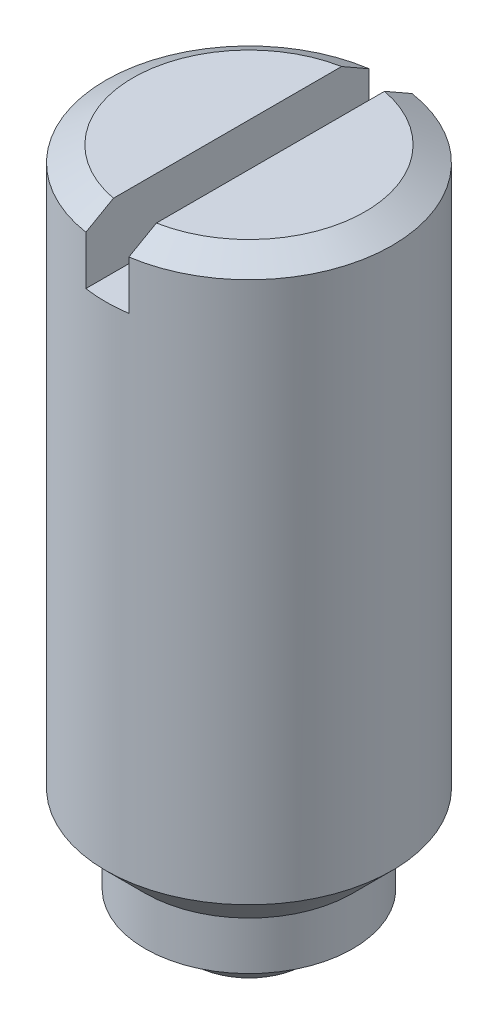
ISO-10303-21;
HEADER;
FILE_DESCRIPTION(('STEP AP214'),'2;1');
FILE_NAME('part.step','',(''),(''),'','','');
FILE_SCHEMA(('AUTOMOTIVE_DESIGN { 1 0 10303 214 1 1 1 1 }'));
ENDSEC;
DATA;
#1=APPLICATION_CONTEXT('core data for automotive mechanical design processes');
#2=APPLICATION_PROTOCOL_DEFINITION('international standard','automotive_design',2000,#1);
#3=PRODUCT_CONTEXT('',#1,'mechanical');
#4=PRODUCT('Part','Part','',(#3));
#5=PRODUCT_RELATED_PRODUCT_CATEGORY('part','',(#4));
#6=PRODUCT_DEFINITION_FORMATION('','',#4);
#7=PRODUCT_DEFINITION_CONTEXT('part definition',#1,'design');
#8=PRODUCT_DEFINITION('design','',#6,#7);
#9=PRODUCT_DEFINITION_SHAPE('','',#8);
#10=(LENGTH_UNIT() NAMED_UNIT(*) SI_UNIT(.MILLI.,.METRE.));
#11=(NAMED_UNIT(*) PLANE_ANGLE_UNIT() SI_UNIT($,.RADIAN.));
#12=(NAMED_UNIT(*) SI_UNIT($,.STERADIAN.) SOLID_ANGLE_UNIT());
#13=UNCERTAINTY_MEASURE_WITH_UNIT(LENGTH_MEASURE(1.E-05),#10,'distance_accuracy_value','');
#14=(GEOMETRIC_REPRESENTATION_CONTEXT(3) GLOBAL_UNCERTAINTY_ASSIGNED_CONTEXT((#13)) GLOBAL_UNIT_ASSIGNED_CONTEXT((#10,
#11,#12)) REPRESENTATION_CONTEXT('',''));
#15=CARTESIAN_POINT('',(0.,0.,0.));
#16=DIRECTION('',(0.,0.,1.));
#17=DIRECTION('',(1.,0.,0.));
#18=AXIS2_PLACEMENT_3D('',#15,#16,#17);
#19=CARTESIAN_POINT('',(0.,9.,0.));
#20=DIRECTION('',(0.,-1.,0.));
#21=DIRECTION('',(0.,0.,-1.));
#22=AXIS2_PLACEMENT_3D('',#19,#20,#21);
#23=CONICAL_SURFACE('',#22,1.621125,1.0471975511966);
#24=CARTESIAN_POINT('',(-0.3,7.95512242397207,-3.41776481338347));
#25=CARTESIAN_POINT('',(-0.3,8.03456601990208,-3.27962757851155));
#26=CARTESIAN_POINT('',(-0.3,8.11398823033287,-3.14147800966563));
#27=CARTESIAN_POINT('',(-0.3,8.27274965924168,-2.86513132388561));
#28=CARTESIAN_POINT('',(-0.3,8.35208887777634,-2.72693420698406));
#29=CARTESIAN_POINT('',(-0.3,8.51064198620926,-2.45047323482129));
#30=CARTESIAN_POINT('',(-0.3,8.58985587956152,-2.3122093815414));
#31=CARTESIAN_POINT('',(-0.3,8.74807950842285,-2.03556492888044));
#32=CARTESIAN_POINT('',(-0.3,8.8270892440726,-1.8971843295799));
#33=CARTESIAN_POINT('',(-0.3,8.94882147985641,-1.68329097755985));
#34=CARTESIAN_POINT('',(-0.3,8.99167880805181,-1.60785501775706));
#35=CARTESIAN_POINT('',(-0.3,9.07721695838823,-1.45688367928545));
#36=CARTESIAN_POINT('',(-0.3,9.11989778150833,-1.38134830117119));
#37=CARTESIAN_POINT('',(-0.3,9.20499700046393,-1.23012724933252));
#38=CARTESIAN_POINT('',(-0.3,9.24741539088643,-1.15444157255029));
#39=CARTESIAN_POINT('',(-0.3,9.33174511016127,-1.00278677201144));
#40=CARTESIAN_POINT('',(-0.3,9.37365642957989,-0.926817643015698));
#41=CARTESIAN_POINT('',(-0.3,9.41519154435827,-0.850640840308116));
#42=B_SPLINE_CURVE_WITH_KNOTS('',3,(#24,#25,#26,#27,#28,#29,#30,#31,#32,#33,#34,#35,#36,#37,#38,
#39,#40,#41),.UNSPECIFIED.,.F.,.F.,(4,2,2,2,2,2,2,2,4),(0.,0.478057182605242,0.956114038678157,
1.43415748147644,1.91220059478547,2.17248103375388,2.43276002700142,2.69304437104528,
2.9533335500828),.UNSPECIFIED.);
#43=CARTESIAN_POINT('',(-0.3,8.78125641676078,-1.97737199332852));
#44=VERTEX_POINT('',#43);
#45=CARTESIAN_POINT('',(-0.3,9.,-1.5931246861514));
#46=VERTEX_POINT('',#45);
#47=EDGE_CURVE('E160',#44,#46,#42,.T.);
#48=ORIENTED_EDGE('',*,*,#47,.F.);
#49=CARTESIAN_POINT('',(0.,8.78125641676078,0.));
#50=DIRECTION('',(0.,1.,0.));
#51=DIRECTION('',(0.,0.,1.));
#52=AXIS2_PLACEMENT_3D('',#49,#50,#51);
#53=CIRCLE('',#52,2.);
#54=CARTESIAN_POINT('',(-0.3,8.78125641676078,1.97737199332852));
#55=VERTEX_POINT('',#54);
#56=EDGE_CURVE('E92',#44,#55,#53,.T.);
#57=ORIENTED_EDGE('',*,*,#56,.T.);
#58=CARTESIAN_POINT('',(-0.3,9.41519154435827,0.850640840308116));
#59=CARTESIAN_POINT('',(-0.3,9.37365642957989,0.926817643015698));
#60=CARTESIAN_POINT('',(-0.3,9.33174511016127,1.00278677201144));
#61=CARTESIAN_POINT('',(-0.3,9.24741539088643,1.15444157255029));
#62=CARTESIAN_POINT('',(-0.3,9.20499700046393,1.23012724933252));
#63=CARTESIAN_POINT('',(-0.3,9.11989778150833,1.38134830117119));
#64=CARTESIAN_POINT('',(-0.3,9.07721695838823,1.45688367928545));
#65=CARTESIAN_POINT('',(-0.3,8.99167880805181,1.60785501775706));
#66=CARTESIAN_POINT('',(-0.3,8.94882147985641,1.68329097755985));
#67=CARTESIAN_POINT('',(-0.3,8.8270892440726,1.8971843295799));
#68=CARTESIAN_POINT('',(-0.3,8.74807950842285,2.03556492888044));
#69=CARTESIAN_POINT('',(-0.3,8.58985587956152,2.3122093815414));
#70=CARTESIAN_POINT('',(-0.3,8.51064198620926,2.45047323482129));
#71=CARTESIAN_POINT('',(-0.3,8.35208887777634,2.72693420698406));
#72=CARTESIAN_POINT('',(-0.3,8.27274965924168,2.86513132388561));
#73=CARTESIAN_POINT('',(-0.3,8.11398823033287,3.14147800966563));
#74=CARTESIAN_POINT('',(-0.3,8.03456601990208,3.27962757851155));
#75=CARTESIAN_POINT('',(-0.3,7.95512242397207,3.41776481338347));
#76=B_SPLINE_CURVE_WITH_KNOTS('',3,(#58,#59,#60,#61,#62,#63,#64,#65,#66,#67,#68,#69,#70,#71,#72,
#73,#74,#75),.UNSPECIFIED.,.F.,.F.,(4,2,2,2,2,2,2,2,4),(0.,0.260289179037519,0.520573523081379,
0.780852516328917,1.04113295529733,1.51917606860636,1.99721951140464,2.47527636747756,
2.9533335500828),.UNSPECIFIED.);
#77=CARTESIAN_POINT('',(-0.3,9.,1.5931246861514));
#78=VERTEX_POINT('',#77);
#79=EDGE_CURVE('E155',#78,#55,#76,.T.);
#80=ORIENTED_EDGE('',*,*,#79,.F.);
#81=CARTESIAN_POINT('',(0.,9.,0.));
#82=DIRECTION('',(0.,1.,0.));
#83=DIRECTION('',(0.,0.,1.));
#84=AXIS2_PLACEMENT_3D('',#81,#82,#83);
#85=CIRCLE('',#84,1.621125);
#86=EDGE_CURVE('E93',#46,#78,#85,.T.);
#87=ORIENTED_EDGE('',*,*,#86,.F.);
#88=EDGE_LOOP('',(#48,#57,#80,#87));
#89=FACE_BOUND('',#88,.T.);
#90=ADVANCED_FACE('F15',(#89),#23,.T.);
#91=CARTESIAN_POINT('',(0.,9.,0.));
#92=DIRECTION('',(0.,1.,0.));
#93=DIRECTION('',(0.,0.,1.));
#94=AXIS2_PLACEMENT_3D('',#91,#92,#93);
#95=PLANE('',#94);
#96=DIRECTION('',(0.,0.,1.));
#97=VECTOR('',#96,1.);
#98=CARTESIAN_POINT('',(-0.3,9.,-2.));
#99=LINE('',#98,#97);
#100=EDGE_CURVE('E79',#46,#78,#99,.T.);
#101=ORIENTED_EDGE('',*,*,#100,.F.);
#102=ORIENTED_EDGE('',*,*,#86,.T.);
#103=EDGE_LOOP('',(#101,#102));
#104=FACE_BOUND('',#103,.T.);
#105=ADVANCED_FACE('F173',(#104),#95,.T.);
#106=CARTESIAN_POINT('',(0.,9.,0.));
#107=DIRECTION('',(0.,1.,0.));
#108=DIRECTION('',(0.,0.,1.));
#109=AXIS2_PLACEMENT_3D('',#106,#107,#108);
#110=CYLINDRICAL_SURFACE('',#109,1.25);
#111=CARTESIAN_POINT('',(0.,0.45,0.));
#112=DIRECTION('',(0.,-1.,0.));
#113=DIRECTION('',(0.,0.,-1.));
#114=AXIS2_PLACEMENT_3D('',#111,#112,#113);
#115=CIRCLE('',#114,1.25);
#116=CARTESIAN_POINT('',(0.,0.45,-1.25));
#117=VERTEX_POINT('',#116);
#118=EDGE_CURVE('E176',#117,#117,#115,.T.);
#119=ORIENTED_EDGE('',*,*,#118,.F.);
#120=EDGE_LOOP('',(#119));
#121=FACE_BOUND('',#120,.T.);
#122=CARTESIAN_POINT('',(0.,0.,0.));
#123=DIRECTION('',(0.,1.,0.));
#124=DIRECTION('',(0.,0.,1.));
#125=AXIS2_PLACEMENT_3D('',#122,#123,#124);
#126=CIRCLE('',#125,1.25);
#127=CARTESIAN_POINT('',(0.,0.,1.25));
#128=VERTEX_POINT('',#127);
#129=EDGE_CURVE('E110',#128,#128,#126,.T.);
#130=ORIENTED_EDGE('',*,*,#129,.F.);
#131=EDGE_LOOP('',(#130));
#132=FACE_BOUND('',#131,.T.);
#133=ADVANCED_FACE('F17',(#121,#132),#110,.F.);
#134=CARTESIAN_POINT('',(1.25,0.,0.));
#135=DIRECTION('',(0.,1.,0.));
#136=DIRECTION('',(0.,0.,1.));
#137=AXIS2_PLACEMENT_3D('',#134,#135,#136);
#138=PLANE('',#137);
#139=CARTESIAN_POINT('',(0.,0.,0.));
#140=DIRECTION('',(0.,1.,0.));
#141=DIRECTION('',(0.,0.,1.));
#142=AXIS2_PLACEMENT_3D('',#139,#140,#141);
#143=CIRCLE('',#142,1.45);
#144=CARTESIAN_POINT('',(0.,0.,1.45));
#145=VERTEX_POINT('',#144);
#146=EDGE_CURVE('E108',#145,#145,#143,.T.);
#147=ORIENTED_EDGE('',*,*,#146,.F.);
#148=EDGE_LOOP('',(#147));
#149=FACE_BOUND('',#148,.T.);
#150=ORIENTED_EDGE('',*,*,#129,.T.);
#151=EDGE_LOOP('',(#150));
#152=FACE_BOUND('',#151,.T.);
#153=ADVANCED_FACE('F184',(#149,#152),#138,.F.);
#154=CARTESIAN_POINT('',(0.,9.,0.));
#155=DIRECTION('',(0.,1.,0.));
#156=DIRECTION('',(0.,0.,1.));
#157=AXIS2_PLACEMENT_3D('',#154,#155,#156);
#158=CYLINDRICAL_SURFACE('',#157,1.45);
#159=CARTESIAN_POINT('',(0.,0.67125641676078,0.));
#160=DIRECTION('',(0.,1.,0.));
#161=DIRECTION('',(0.,0.,1.));
#162=AXIS2_PLACEMENT_3D('',#159,#160,#161);
#163=CIRCLE('',#162,1.45);
#164=CARTESIAN_POINT('',(0.,0.67125641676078,1.45));
#165=VERTEX_POINT('',#164);
#166=EDGE_CURVE('E105',#165,#165,#163,.T.);
#167=ORIENTED_EDGE('',*,*,#166,.F.);
#168=EDGE_LOOP('',(#167));
#169=FACE_BOUND('',#168,.T.);
#170=ORIENTED_EDGE('',*,*,#146,.T.);
#171=EDGE_LOOP('',(#170));
#172=FACE_BOUND('',#171,.T.);
#173=ADVANCED_FACE('F188',(#169,#172),#158,.T.);
#174=CARTESIAN_POINT('',(0.,1.22125641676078,0.));
#175=DIRECTION('',(0.,1.,0.));
#176=DIRECTION('',(0.,0.,1.));
#177=AXIS2_PLACEMENT_3D('',#174,#175,#176);
#178=CONICAL_SURFACE('',#177,2.,0.785398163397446);
#179=ORIENTED_EDGE('',*,*,#166,.T.);
#180=EDGE_LOOP('',(#179));
#181=FACE_BOUND('',#180,.T.);
#182=CARTESIAN_POINT('',(0.,1.22125641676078,0.));
#183=DIRECTION('',(0.,1.,0.));
#184=DIRECTION('',(0.,0.,1.));
#185=AXIS2_PLACEMENT_3D('',#182,#183,#184);
#186=CIRCLE('',#185,2.);
#187=CARTESIAN_POINT('',(0.,1.22125641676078,2.));
#188=VERTEX_POINT('',#187);
#189=EDGE_CURVE('E102',#188,#188,#186,.T.);
#190=ORIENTED_EDGE('',*,*,#189,.F.);
#191=EDGE_LOOP('',(#190));
#192=FACE_BOUND('',#191,.T.);
#193=ADVANCED_FACE('F197',(#181,#192),#178,.T.);
#194=CARTESIAN_POINT('',(0.,9.,0.));
#195=DIRECTION('',(0.,1.,0.));
#196=DIRECTION('',(0.,0.,1.));
#197=AXIS2_PLACEMENT_3D('',#194,#195,#196);
#198=CYLINDRICAL_SURFACE('',#197,2.);
#199=DIRECTION('',(0.,1.,0.));
#200=VECTOR('',#199,1.);
#201=CARTESIAN_POINT('',(-0.3,9.,1.97737199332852));
#202=LINE('',#201,#200);
#203=CARTESIAN_POINT('',(-0.3,8.1,1.97737199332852));
#204=VERTEX_POINT('',#203);
#205=EDGE_CURVE('E164',#55,#204,#202,.F.);
#206=ORIENTED_EDGE('',*,*,#205,.F.);
#207=ORIENTED_EDGE('',*,*,#56,.F.);
#208=DIRECTION('',(0.,1.,0.));
#209=VECTOR('',#208,1.);
#210=CARTESIAN_POINT('',(-0.3,9.,-1.97737199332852));
#211=LINE('',#210,#209);
#212=CARTESIAN_POINT('',(-0.3,8.1,-1.97737199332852));
#213=VERTEX_POINT('',#212);
#214=EDGE_CURVE('E98',#213,#44,#211,.T.);
#215=ORIENTED_EDGE('',*,*,#214,.F.);
#216=CARTESIAN_POINT('',(0.,8.1,0.));
#217=DIRECTION('',(0.,-1.,0.));
#218=DIRECTION('',(0.,0.,-1.));
#219=AXIS2_PLACEMENT_3D('',#216,#217,#218);
#220=CIRCLE('',#219,2.);
#221=CARTESIAN_POINT('',(0.,8.1,-2.));
#222=VERTEX_POINT('',#221);
#223=EDGE_CURVE('E114',#222,#213,#220,.F.);
#224=ORIENTED_EDGE('',*,*,#223,.F.);
#225=CARTESIAN_POINT('',(0.3,8.1,-1.97737199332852));
#226=VERTEX_POINT('',#225);
#227=EDGE_CURVE('E19',#226,#222,#220,.F.);
#228=ORIENTED_EDGE('',*,*,#227,.F.);
#229=DIRECTION('',(0.,1.,0.));
#230=VECTOR('',#229,1.);
#231=CARTESIAN_POINT('',(0.3,9.,-1.97737199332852));
#232=LINE('',#231,#230);
#233=CARTESIAN_POINT('',(0.3,8.78125641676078,-1.97737199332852));
#234=VERTEX_POINT('',#233);
#235=EDGE_CURVE('E88',#234,#226,#232,.F.);
#236=ORIENTED_EDGE('',*,*,#235,.F.);
#237=CARTESIAN_POINT('',(0.3,8.78125641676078,1.97737199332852));
#238=VERTEX_POINT('',#237);
#239=EDGE_CURVE('E87',#238,#234,#53,.T.);
#240=ORIENTED_EDGE('',*,*,#239,.F.);
#241=DIRECTION('',(0.,1.,0.));
#242=VECTOR('',#241,1.);
#243=CARTESIAN_POINT('',(0.3,9.,1.97737199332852));
#244=LINE('',#243,#242);
#245=CARTESIAN_POINT('',(0.3,8.1,1.97737199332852));
#246=VERTEX_POINT('',#245);
#247=EDGE_CURVE('E89',#246,#238,#244,.T.);
#248=ORIENTED_EDGE('',*,*,#247,.F.);
#249=CARTESIAN_POINT('',(0.,8.1,2.));
#250=VERTEX_POINT('',#249);
#251=EDGE_CURVE('E24',#250,#246,#220,.F.);
#252=ORIENTED_EDGE('',*,*,#251,.F.);
#253=EDGE_CURVE('E10',#204,#250,#220,.F.);
#254=ORIENTED_EDGE('',*,*,#253,.F.);
#255=EDGE_LOOP('',(#206,#207,#215,#224,#228,#236,#240,#248,#252,#254));
#256=FACE_BOUND('',#255,.T.);
#257=ORIENTED_EDGE('',*,*,#189,.T.);
#258=EDGE_LOOP('',(#257));
#259=FACE_BOUND('',#258,.T.);
#260=ADVANCED_FACE('F126',(#256,#259),#198,.T.);
#261=CARTESIAN_POINT('',(0.3,9.41519154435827,-0.850640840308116));
#262=CARTESIAN_POINT('',(0.3,9.37365642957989,-0.926817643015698));
#263=CARTESIAN_POINT('',(0.3,9.33174511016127,-1.00278677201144));
#264=CARTESIAN_POINT('',(0.3,9.24741539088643,-1.15444157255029));
#265=CARTESIAN_POINT('',(0.3,9.20499700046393,-1.23012724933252));
#266=CARTESIAN_POINT('',(0.3,9.11989778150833,-1.38134830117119));
#267=CARTESIAN_POINT('',(0.3,9.07721695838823,-1.45688367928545));
#268=CARTESIAN_POINT('',(0.3,8.99167880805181,-1.60785501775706));
#269=CARTESIAN_POINT('',(0.3,8.94882147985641,-1.68329097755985));
#270=CARTESIAN_POINT('',(0.3,8.8270892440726,-1.8971843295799));
#271=CARTESIAN_POINT('',(0.3,8.74807950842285,-2.03556492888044));
#272=CARTESIAN_POINT('',(0.3,8.58985587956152,-2.3122093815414));
#273=CARTESIAN_POINT('',(0.3,8.51064198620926,-2.45047323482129));
#274=CARTESIAN_POINT('',(0.3,8.35208887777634,-2.72693420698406));
#275=CARTESIAN_POINT('',(0.3,8.27274965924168,-2.86513132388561));
#276=CARTESIAN_POINT('',(0.3,8.11398823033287,-3.14147800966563));
#277=CARTESIAN_POINT('',(0.3,8.03456601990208,-3.27962757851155));
#278=CARTESIAN_POINT('',(0.3,7.95512242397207,-3.41776481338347));
#279=B_SPLINE_CURVE_WITH_KNOTS('',3,(#261,#262,#263,#264,#265,#266,#267,#268,#269,#270,#271,
#272,#273,#274,#275,#276,#277,#278),.UNSPECIFIED.,.F.,.F.,(4,2,2,2,2,2,2,2,4),(0.,
0.260289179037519,0.520573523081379,0.780852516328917,1.04113295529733,1.51917606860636,
1.99721951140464,2.47527636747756,2.9533335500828),.UNSPECIFIED.);
#280=CARTESIAN_POINT('',(0.3,9.,-1.5931246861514));
#281=VERTEX_POINT('',#280);
#282=EDGE_CURVE('E74',#281,#234,#279,.T.);
#283=ORIENTED_EDGE('',*,*,#282,.F.);
#284=CARTESIAN_POINT('',(0.3,9.,1.5931246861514));
#285=VERTEX_POINT('',#284);
#286=EDGE_CURVE('E85',#285,#281,#85,.T.);
#287=ORIENTED_EDGE('',*,*,#286,.F.);
#288=CARTESIAN_POINT('',(0.3,7.95512242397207,3.41776481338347));
#289=CARTESIAN_POINT('',(0.3,8.03456601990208,3.27962757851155));
#290=CARTESIAN_POINT('',(0.3,8.11398823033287,3.14147800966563));
#291=CARTESIAN_POINT('',(0.3,8.27274965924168,2.86513132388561));
#292=CARTESIAN_POINT('',(0.3,8.35208887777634,2.72693420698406));
#293=CARTESIAN_POINT('',(0.3,8.51064198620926,2.45047323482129));
#294=CARTESIAN_POINT('',(0.3,8.58985587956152,2.3122093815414));
#295=CARTESIAN_POINT('',(0.3,8.74807950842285,2.03556492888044));
#296=CARTESIAN_POINT('',(0.3,8.8270892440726,1.8971843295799));
#297=CARTESIAN_POINT('',(0.3,8.94882147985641,1.68329097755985));
#298=CARTESIAN_POINT('',(0.3,8.99167880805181,1.60785501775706));
#299=CARTESIAN_POINT('',(0.3,9.07721695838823,1.45688367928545));
#300=CARTESIAN_POINT('',(0.3,9.11989778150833,1.38134830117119));
#301=CARTESIAN_POINT('',(0.3,9.20499700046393,1.23012724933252));
#302=CARTESIAN_POINT('',(0.3,9.24741539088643,1.15444157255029));
#303=CARTESIAN_POINT('',(0.3,9.33174511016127,1.00278677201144));
#304=CARTESIAN_POINT('',(0.3,9.37365642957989,0.926817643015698));
#305=CARTESIAN_POINT('',(0.3,9.41519154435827,0.850640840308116));
#306=B_SPLINE_CURVE_WITH_KNOTS('',3,(#288,#289,#290,#291,#292,#293,#294,#295,#296,#297,#298,
#299,#300,#301,#302,#303,#304,#305),.UNSPECIFIED.,.F.,.F.,(4,2,2,2,2,2,2,2,4),(0.,
0.478057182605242,0.956114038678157,1.43415748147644,1.91220059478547,2.17248103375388,
2.43276002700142,2.69304437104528,2.9533335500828),.UNSPECIFIED.);
#307=EDGE_CURVE('E31',#238,#285,#306,.T.);
#308=ORIENTED_EDGE('',*,*,#307,.F.);
#309=ORIENTED_EDGE('',*,*,#239,.T.);
#310=EDGE_LOOP('',(#283,#287,#308,#309));
#311=FACE_BOUND('',#310,.T.);
#312=ADVANCED_FACE('F84',(#311),#23,.T.);
#313=DIRECTION('',(0.,0.,1.));
#314=VECTOR('',#313,1.);
#315=CARTESIAN_POINT('',(0.3,9.,-2.));
#316=LINE('',#315,#314);
#317=EDGE_CURVE('E71',#281,#285,#316,.T.);
#318=ORIENTED_EDGE('',*,*,#317,.T.);
#319=ORIENTED_EDGE('',*,*,#286,.T.);
#320=EDGE_LOOP('',(#318,#319));
#321=FACE_BOUND('',#320,.T.);
#322=ADVANCED_FACE('F91',(#321),#95,.T.);
#323=CARTESIAN_POINT('',(-0.3,8.55,-2.));
#324=DIRECTION('',(-1.,0.,0.));
#325=DIRECTION('',(0.,0.,-1.));
#326=AXIS2_PLACEMENT_3D('',#323,#324,#325);
#327=PLANE('',#326);
#328=ORIENTED_EDGE('',*,*,#214,.T.);
#329=ORIENTED_EDGE('',*,*,#47,.T.);
#330=ORIENTED_EDGE('',*,*,#100,.T.);
#331=ORIENTED_EDGE('',*,*,#79,.T.);
#332=ORIENTED_EDGE('',*,*,#205,.T.);
#333=DIRECTION('',(0.,0.,1.));
#334=VECTOR('',#333,1.);
#335=CARTESIAN_POINT('',(-0.3,8.1,-2.));
#336=LINE('',#335,#334);
#337=EDGE_CURVE('E123',#213,#204,#336,.T.);
#338=ORIENTED_EDGE('',*,*,#337,.F.);
#339=EDGE_LOOP('',(#328,#329,#330,#331,#332,#338));
#340=FACE_BOUND('',#339,.T.);
#341=ADVANCED_FACE('F148',(#340),#327,.F.);
#342=CARTESIAN_POINT('',(0.3,8.55,-2.));
#343=DIRECTION('',(1.,0.,0.));
#344=DIRECTION('',(0.,0.,1.));
#345=AXIS2_PLACEMENT_3D('',#342,#343,#344);
#346=PLANE('',#345);
#347=ORIENTED_EDGE('',*,*,#235,.T.);
#348=DIRECTION('',(0.,0.,1.));
#349=VECTOR('',#348,1.);
#350=CARTESIAN_POINT('',(0.3,8.1,-2.));
#351=LINE('',#350,#349);
#352=EDGE_CURVE('E80',#226,#246,#351,.T.);
#353=ORIENTED_EDGE('',*,*,#352,.T.);
#354=ORIENTED_EDGE('',*,*,#247,.T.);
#355=ORIENTED_EDGE('',*,*,#307,.T.);
#356=ORIENTED_EDGE('',*,*,#317,.F.);
#357=ORIENTED_EDGE('',*,*,#282,.T.);
#358=EDGE_LOOP('',(#347,#353,#354,#355,#356,#357));
#359=FACE_BOUND('',#358,.T.);
#360=ADVANCED_FACE('F73',(#359),#346,.F.);
#361=CARTESIAN_POINT('',(0.,8.1,-2.));
#362=DIRECTION('',(0.,-1.,0.));
#363=DIRECTION('',(0.,0.,-1.));
#364=AXIS2_PLACEMENT_3D('',#361,#362,#363);
#365=PLANE('',#364);
#366=ORIENTED_EDGE('',*,*,#253,.T.);
#367=ORIENTED_EDGE('',*,*,#251,.T.);
#368=ORIENTED_EDGE('',*,*,#352,.F.);
#369=ORIENTED_EDGE('',*,*,#227,.T.);
#370=ORIENTED_EDGE('',*,*,#223,.T.);
#371=ORIENTED_EDGE('',*,*,#337,.T.);
#372=EDGE_LOOP('',(#366,#367,#368,#369,#370,#371));
#373=FACE_BOUND('',#372,.T.);
#374=ADVANCED_FACE('F120',(#373),#365,.F.);
#375=CARTESIAN_POINT('',(0.,0.45,0.));
#376=DIRECTION('',(0.,0.,1.));
#377=DIRECTION('',(0.,-1.,0.));
#378=AXIS2_PLACEMENT_3D('',#375,#376,#377);
#379=SPHERICAL_SURFACE('',#378,1.25);
#380=CARTESIAN_POINT('',(0.,0.45,0.));
#381=DIRECTION('',(0.,-1.,0.));
#382=DIRECTION('',(0.,0.,-1.));
#383=AXIS2_PLACEMENT_3D('',#380,#381,#382);
#384=SPHERICAL_SURFACE('',#383,1.25);
#385=ORIENTED_EDGE('',*,*,#118,.T.);
#386=EDGE_LOOP('',(#385));
#387=FACE_BOUND('',#386,.T.);
#388=ADVANCED_FACE('F180',(#387),#384,.T.);
#389=CLOSED_SHELL('',(#90,#105,#133,#153,#173,#193,#260,#312,#322,#341,#360,#374,#388));
#390=MANIFOLD_SOLID_BREP('B1',#389);
#391=ADVANCED_BREP_SHAPE_REPRESENTATION('',(#18,#390),#14);
#392=SHAPE_DEFINITION_REPRESENTATION(#9,#391);
ENDSEC;
END-ISO-10303-21;
